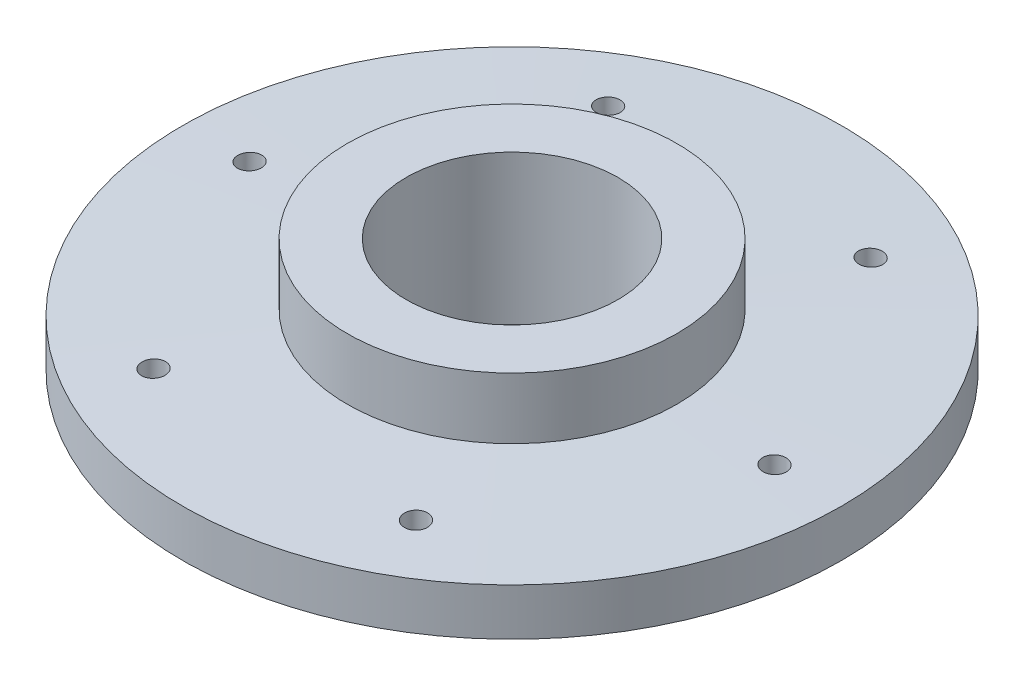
from build123d import *

# Parameters (mm, degrees)
ESQUISSE2_W                   = 2.954484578
ESQUISSE2_H                   = 0.5
ESQUISSE3_W                   = 0.5
ESQUISSE3_H                   = 2.954484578
ESQUISSE4_W                   = 2.954484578
ESQUISSE4_H                   = 0.5
ESQUISSE5_W                   = 0.5
ESQUISSE5_H                   = 2.954484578
ESQUISSE6_W                   = 2.954484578
ESQUISSE6_H                   = 0.5
ESQUISSE7_W                   = 2.954484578
ESQUISSE7_H                   = 0.5
DIAM_TRE_DU_PER_AGE_9_0_9_1_D = 9


with BuildPart() as part:
    # Esquisse1 → R_volution1 (revolve)
    with BuildSketch(Plane.XY):
        Polygon((7, 6.344445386), (0, 6.344445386), (0, 0), (8, 0), (14, 1.5), (14, 3.5), (7, 3.744445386), align=None)
    revolve(axis=Axis((0, 6.344445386, 0), (0, -1, 0)))

    # Esquisse2 → Enl_vement de mati_re-R_volution1 (revolve, cut)
    with BuildSketch(Plane(origin=(0, 0, 0), x_dir=(0, 1, 0), z_dir=(0.8660254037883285, 0, 0.4999999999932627)), mode=Mode.PRIVATE) as enl_vement_de_mati_re_r_volution1_sk:
        with Locations((2.139742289, 11.4)):
            Rectangle(ESQUISSE2_W, ESQUISSE2_H)
    revolve(enl_vement_de_mati_re_r_volution1_sk.sketch.rotate(Axis((-5.575, 0.6625, 9.656183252), (0, 1, 0)), 255.247772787), axis=Axis((-5.575, 0.6625, 9.656183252), (0, 1, 0)), mode=Mode.SUBTRACT)

    # Esquisse3 → Enl_vement de mati_re-R_volution2 (revolve, cut)
    with BuildSketch(Plane.XY, mode=Mode.PRIVATE) as enl_vement_de_mati_re_r_volution2_sk:
        with Locations((-10.9, 2.139742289)):
            Rectangle(ESQUISSE3_W, ESQUISSE3_H)
    revolve(enl_vement_de_mati_re_r_volution2_sk.sketch.rotate(Axis((-11.15, 3.616984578, 0), (0, -1, 0)), 227.095534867), axis=Axis((-11.15, 3.616984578, 0), (0, -1, 0)), mode=Mode.SUBTRACT)

    # Esquisse4 → Enl_vement de mati_re-R_volution3 (revolve, cut)
    with BuildSketch(Plane(origin=(0, 0, 0), x_dir=(0, 1, 0), z_dir=(0.8660254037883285, 0, 0.4999999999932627)), mode=Mode.PRIVATE) as enl_vement_de_mati_re_r_volution3_sk:
        with Locations((2.139742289, -11.4)):
            Rectangle(ESQUISSE4_W, ESQUISSE4_H)
    revolve(enl_vement_de_mati_re_r_volution3_sk.sketch.rotate(Axis((5.575, 3.616984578, -9.656183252), (0, -1, 0)), 285.137789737), axis=Axis((5.575, 3.616984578, -9.656183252), (0, -1, 0)), mode=Mode.SUBTRACT)

    # Esquisse5 → Enl_vement de mati_re-R_volution4 (revolve, cut)
    with BuildSketch(Plane.XY):
        with Locations((11.4, 2.139742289)):
            Rectangle(ESQUISSE5_W, ESQUISSE5_H)
    revolve(axis=Axis((11.15, 3.616984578, 0), (0, -1, 0)), mode=Mode.SUBTRACT)

    # Esquisse6 → Enl_vement de mati_re-R_volution5 (revolve, cut)
    with BuildSketch(Plane(origin=(0, 0, 0), x_dir=(0, 1, 0), z_dir=(0.8660254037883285, 0, -0.4999999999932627)), mode=Mode.PRIVATE) as enl_vement_de_mati_re_r_volution5_sk:
        with Locations((2.139742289, 11.4)):
            Rectangle(ESQUISSE6_W, ESQUISSE6_H)
    revolve(enl_vement_de_mati_re_r_volution5_sk.sketch.rotate(Axis((5.575, 0.6625, 9.656183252), (0, 1, 0)), 195.775890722), axis=Axis((5.575, 0.6625, 9.656183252), (0, 1, 0)), mode=Mode.SUBTRACT)

    # Esquisse7 → Enl_vement de mati_re-R_volution6 (revolve, cut)
    with BuildSketch(Plane(origin=(0, 0, 0), x_dir=(0, 1, 0), z_dir=(0.8660254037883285, 0, -0.4999999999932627)), mode=Mode.PRIVATE) as enl_vement_de_mati_re_r_volution6_sk:
        with Locations((2.139742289, -11.4)):
            Rectangle(ESQUISSE7_W, ESQUISSE7_H)
    revolve(enl_vement_de_mati_re_r_volution6_sk.sketch.rotate(Axis((-5.575, 3.616984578, -9.656183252), (0, -1, 0)), 345.482275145), axis=Axis((-5.575, 3.616984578, -9.656183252), (0, -1, 0)), mode=Mode.SUBTRACT)

    # Diam_tre du per_age _9.0 _9_1 (through all)
    with Locations(Plane.XZ):
        with Locations((0, 0)):
            Hole(DIAM_TRE_DU_PER_AGE_9_0_9_1_D / 2)


solid = part.part
